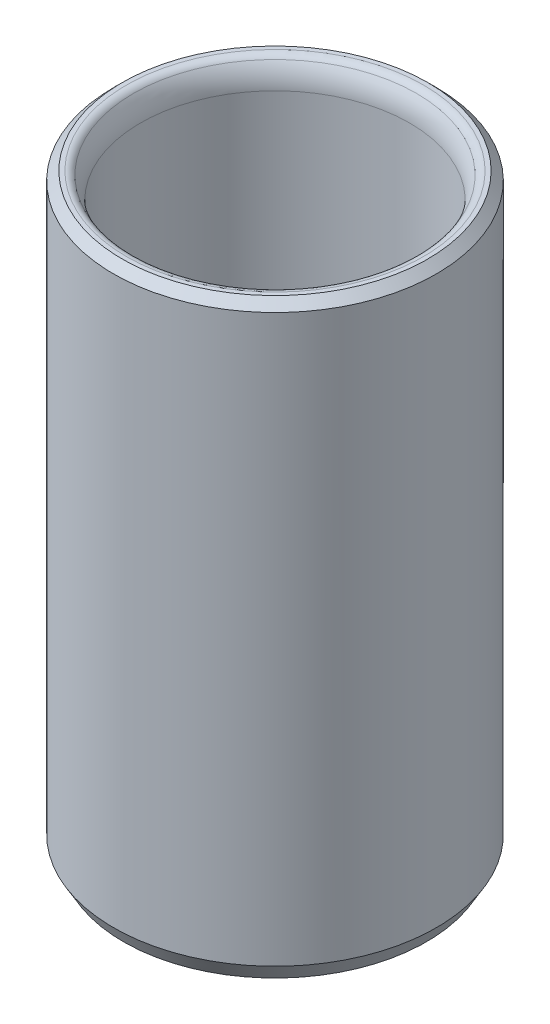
from build123d import *

# Parameters (mm, degrees)
F_5_16_18_TAPPED_HOLE1_D     = 6.6294
F_5_16_18_TAPPED_HOLE1_DEPTH = 19.4818
F_5_16_18_TAPPED_HOLE1_TIP   = 1.991672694
SKETCH4_W                    = 0.127
SKETCH4_H                    = 3.175
CUT_EXTRUDE1_DEPTH           = 38.432697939
SKETCH5_R                    = 0.79375
CUT_EXTRUDE2_DEPTH           = 2.54


with BuildPart() as part:
    # Sketch1 → Revolve1 (revolve)
    with BuildSketch(Plane.XY, mode=Mode.PRIVATE) as revolve1_sk:
        with BuildLine():
            Line((0, -34.925), (8.938412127, -34.925))
            Line((8.938412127, -34.925), (9.525, -33.909))
            Line((9.525, -33.909), (9.525, -0.508))
            Line((9.525, -0.508), (9.017, 0))
            Line((9.017, 0), (8.764381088, 0))
            ThreePointArc((8.764381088, 0), (8.529222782, -0.057706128), (8.34748997, -0.217714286))
            ThreePointArc((8.34748997, -0.217714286), (8.042404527, -0.839442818), (7.9375, -1.524))
            Line((7.9375, -1.524), (7.9375, -22.479))
            ThreePointArc((7.9375, -22.479), (7.788710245, -22.838210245), (7.4295, -22.987))
            Line((7.4295, -22.987), (0, -22.987))
            Line((0, -22.987), (0, -34.925))
        make_face()
    revolve(revolve1_sk.sketch.rotate(Axis((0, -34.925, 0), (0, 1, 0)), 90), axis=Axis((0, -34.925, 0), (0, 1, 0)))

    # 5_16-18 Tapped Hole1
    with Locations(Plane(origin=(0, -22.987, 0), x_dir=(1, 0, 0), z_dir=(0, 1, 0))):
        with Locations((0, 0)):
            Hole(F_5_16_18_TAPPED_HOLE1_D / 2, depth=F_5_16_18_TAPPED_HOLE1_DEPTH)
            with Locations((0, 0, -(F_5_16_18_TAPPED_HOLE1_DEPTH + F_5_16_18_TAPPED_HOLE1_TIP / 2))):  # 118° drill point
                Cone(0, F_5_16_18_TAPPED_HOLE1_D / 2, F_5_16_18_TAPPED_HOLE1_TIP, mode=Mode.SUBTRACT)

    # Sketch4 → Cut-Extrude1 (cut, through all)
    with BuildSketch(Plane(origin=(0, 0, 0), x_dir=(1, 0, 0), z_dir=(0, 1, 0))):
        with Locations((-9.4615, 0)):
            Rectangle(SKETCH4_W, SKETCH4_H)
    extrude(amount=-CUT_EXTRUDE1_DEPTH, mode=Mode.SUBTRACT)

    # Sketch5 → Cut-Extrude2 (cut)
    with BuildSketch(Plane.ZY.offset(9.398)):
        with Locations((0, -19.05)):
            Circle(SKETCH5_R)
    extrude(amount=-CUT_EXTRUDE2_DEPTH, mode=Mode.SUBTRACT)


solid = part.part
